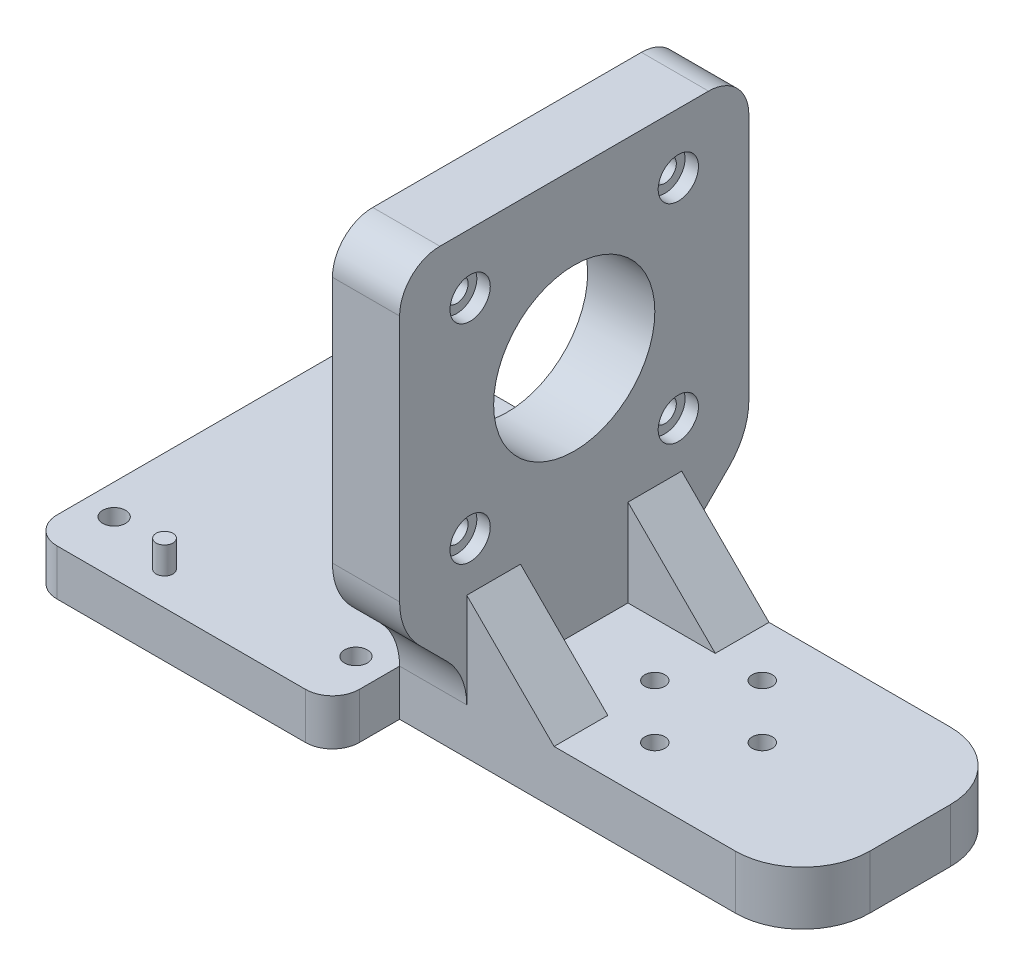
from build123d import *

# Parameters (mm, degrees)
SKETCH_2_W                   = 60
SKETCH_2_H                   = 32
SKETCH_2_R                   = 1.5
EXTRUDE_2_DEPTH              = 8
SKETCH_4_W                   = 10
SKETCH_4_H                   = 32
EXTRUDE_3_DEPTH              = 60
RIB_1_REACH                  = 76.324
SKETCH_6_WALL_W              = 169.03200972
SKETCH_6_WALL_H              = 8
FILLET_2_R                   = 10
FILLET_3_R                   = 10
SKETCH_9_W                   = 10
SKETCH_9_H                   = 47
EXTRUDE_4_DEPTH              = 10
EXTRUDE_5_DEPTH              = 10
FILLET_5_R                   = 10
FILLET_6_R                   = 10
FILLET_7_R                   = 10
FILLET_8_R                   = 6
CUT_EXTRUDE_1_DEPTH          = 83.316462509
CUT_EXTRUDE_1_DEPTH_BACK     = 83.316462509
SKETCH_11_R                  = 12
HOLE_WIZARD_M3_1_D           = 3.4
HOLE_WIZARD_M3_1_CBORE_D     = 6
HOLE_WIZARD_M3_1_CBORE_DEPTH = 2
SKETCH_17_W                  = 32
SKETCH_17_H                  = 6.857864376
EXTRUDE_6_DEPTH              = 45
SKETCH_18_W                  = 45
SKETCH_18_H                  = 52
EXTRUDE_9_DEPTH              = 6.857864
FILLET_9_R                   = 4
SKETCH_22_R                  = 1.7
CUT_EXTRUDE_2_DEPTH          = 7
SKETCH_23_R                  = 1.25
EXTRUDE_10_DEPTH             = 4
EXTRUDE_11_DEPTH             = 7


with BuildPart() as part:
    # Sketch 2 → Extrude 2 (new body)
    with BuildSketch(Plane(origin=(0, 0, 0), x_dir=(1, 0, 0), z_dir=(0, 1, 0))):
        Rectangle(SKETCH_2_W, SKETCH_2_H)
        with Locations(Location((0, 8, 0), (0, 0, 270))):
            Circle(SKETCH_2_R, mode=Mode.SUBTRACT)
        with Locations(Location((8, 0, 0), (0, 0, 270))):
            Circle(SKETCH_2_R, mode=Mode.SUBTRACT)
        with Locations(Location((0, -8, 0), (0, 0, 270))):
            Circle(SKETCH_2_R, mode=Mode.SUBTRACT)
        with Locations(Location((-8, 0, 0), (0, 0, 270))):
            Circle(SKETCH_2_R, mode=Mode.SUBTRACT)
    extrude(amount=-EXTRUDE_2_DEPTH)

    # Sketch 4 → Extrude 3 (add)
    with BuildSketch(Plane(origin=(0, 0, 0), x_dir=(1, 0, 0), z_dir=(0, 1, 0))):
        with Locations((-25, 0)):
            Rectangle(SKETCH_4_W, SKETCH_4_H)
    extrude(amount=EXTRUDE_3_DEPTH)

    # Sketch 6 wall → Rib 1 (add, up to next)
    with BuildSketch(Plane(origin=(-13.5, 6.5, 16), x_dir=(0.707106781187, -0.707106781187, 0), z_dir=(0.707106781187, 0.707106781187, 0)), mode=Mode.PRIVATE) as rib_1_sk1:
        with Locations((0, 4)):
            Rectangle(SKETCH_6_WALL_W, SKETCH_6_WALL_H)
    rib_1_tool1 = extrude(rib_1_sk1.sketch, amount=-RIB_1_REACH, mode=Mode.PRIVATE) - part.part
    rib_1 = rib_1_tool1.solids().sort_by_distance((-13.5, 6.5, 16))[0]
    add(rib_1)

    # Mirror 1: Rib 1 across plane
    add(rib_1.mirror(Plane.XY))

    # Fillet 2
    fillet_2_edges = [part.edges().sort_by_distance(p)[0] for p in [
        (30, -4, 16),
    ]]
    fillet(fillet_2_edges, radius=FILLET_2_R)

    # Fillet 3
    fillet_3_edges = [part.edges().sort_by_distance(p)[0] for p in [
        (30, -4, -16),
    ]]
    fillet(fillet_3_edges, radius=FILLET_3_R)

    # Sketch 9 → Extrude 4 (add)
    with BuildSketch(Plane.XY.offset(16)):
        with Locations((-25, 36.5)):
            Rectangle(SKETCH_9_W, SKETCH_9_H)
    extrude_4 = extrude(amount=EXTRUDE_4_DEPTH)

    # Mirror 2: Extrude 4 across plane
    add(extrude_4.mirror(Plane.XY))

    # Sketch 10 → Extrude 5 (add)
    with BuildSketch(Plane.ZY.offset(30)):
        Polygon((-26, 13), (-16, 3), (-16, 13), align=None)
    extrude_5 = extrude(amount=-EXTRUDE_5_DEPTH)

    # Mirror 3: Extrude 5 across plane
    add(extrude_5.mirror(Plane.XY))

    # Fillet 5
    fillet_5_edges = [part.edges().sort_by_distance(p)[0] for p in [
        (-25, 3, 16),
    ]]
    fillet(fillet_5_edges, radius=FILLET_5_R)

    # Fillet 6
    fillet_6_edges = [part.edges().sort_by_distance(p)[0] for p in [
        (-25, 3, -16),
    ]]
    fillet(fillet_6_edges, radius=FILLET_6_R)

    # Fillet 7
    fillet_7_edges = [part.edges().sort_by_distance(p)[0] for p in [
        (-25, 13, 26),
        (-25, 13, -26),
    ]]
    fillet(fillet_7_edges, radius=FILLET_7_R)

    # Fillet 8
    fillet_8_edges = [part.edges().sort_by_distance(p)[0] for p in [
        (-25, 60, 26),
        (-25, 60, -26),
    ]]
    fillet(fillet_8_edges, radius=FILLET_8_R)

    # Sketch 11 → Cut-Extrude 1 (cut, two sides: drawn at the far end of the back side and taken through both)
    with BuildSketch(Plane(origin=(-20, 0, 0), x_dir=(0, 0, -1), z_dir=(1, 0, 0)).offset(-CUT_EXTRUDE_1_DEPTH_BACK)):
        with Locations((0, 35.571067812)):
            Circle(SKETCH_11_R)
    extrude(amount=CUT_EXTRUDE_1_DEPTH + CUT_EXTRUDE_1_DEPTH_BACK, mode=Mode.SUBTRACT)

    # Hole Wizard M3 _1 (through all)
    with Locations(Plane(origin=(-20, 0, 0), x_dir=(0, 0, -1), z_dir=(1, 0, 0))):
        with Locations((-15.5, 51.071067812), (15.5, 51.071067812), (15.5, 20.071067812), (-15.5, 20.071067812)):
            CounterBoreHole(HOLE_WIZARD_M3_1_D / 2, HOLE_WIZARD_M3_1_CBORE_D / 2, HOLE_WIZARD_M3_1_CBORE_DEPTH)

    # Sketch 17 → Extrude 6 (add)
    with BuildSketch(Plane.ZY.offset(30)):
        with Locations((0, -4.571067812)):
            Rectangle(SKETCH_17_W, SKETCH_17_H)
    extrude(amount=EXTRUDE_6_DEPTH)

    # Sketch 18 → Extrude 9 (add)
    with BuildSketch(Plane(origin=(0, -1.142135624, 0), x_dir=(1, 0, 0), z_dir=(0, 1, 0))):
        with Locations((-52.5, 0)):
            Rectangle(SKETCH_18_W, SKETCH_18_H)
    extrude(amount=-EXTRUDE_9_DEPTH)

    # Fillet 9
    fillet_9_edges = [part.edges().sort_by_distance(p)[0] for p in [
        (-75, -4.571067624, 26),
        (-75, -4.571067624, -26),
        (-30, -4.571067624, -26),
        (-30, -4.571067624, 26),
    ]]
    fillet(fillet_9_edges, radius=FILLET_9_R)

    # Sketch 22 → Cut-Extrude 2 (cut)
    with BuildSketch(Plane(origin=(0, -1.142135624, 0), x_dir=(1, 0, 0), z_dir=(0, 1, 0))):
        with Locations(Location((-70.5, 18, 0), (0, 0, 270))):
            Circle(SKETCH_22_R)
        with Locations(Location((-34.5, 18, 0), (0, 0, 270))):
            Circle(SKETCH_22_R)
        with Locations(Location((-34.5, -18, 0), (0, 0, 270))):
            Circle(SKETCH_22_R)
        with Locations(Location((-70.5, -18, 0), (0, 0, 270))):
            Circle(SKETCH_22_R)
    extrude(amount=-CUT_EXTRUDE_2_DEPTH, mode=Mode.SUBTRACT)

    # Sketch 23 → Extrude 10 (add)
    with BuildSketch(Plane(origin=(0, -1.142135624, 0), x_dir=(1, 0, 0), z_dir=(0, 1, 0))):
        with Locations(Location((-60, -21, 0), (0, 0, 90))):
            Circle(SKETCH_23_R)
    extrude(amount=EXTRUDE_10_DEPTH)

    # Sketch 24 → Extrude 11 (add, symmetric)
    with BuildSketch(Plane.XY):
        Polygon((-30, 10.071067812), (-41.213203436, -1.142135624), (-30, -1.142135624), align=None)
    extrude(amount=EXTRUDE_11_DEPTH, both=True)


solid = part.part
